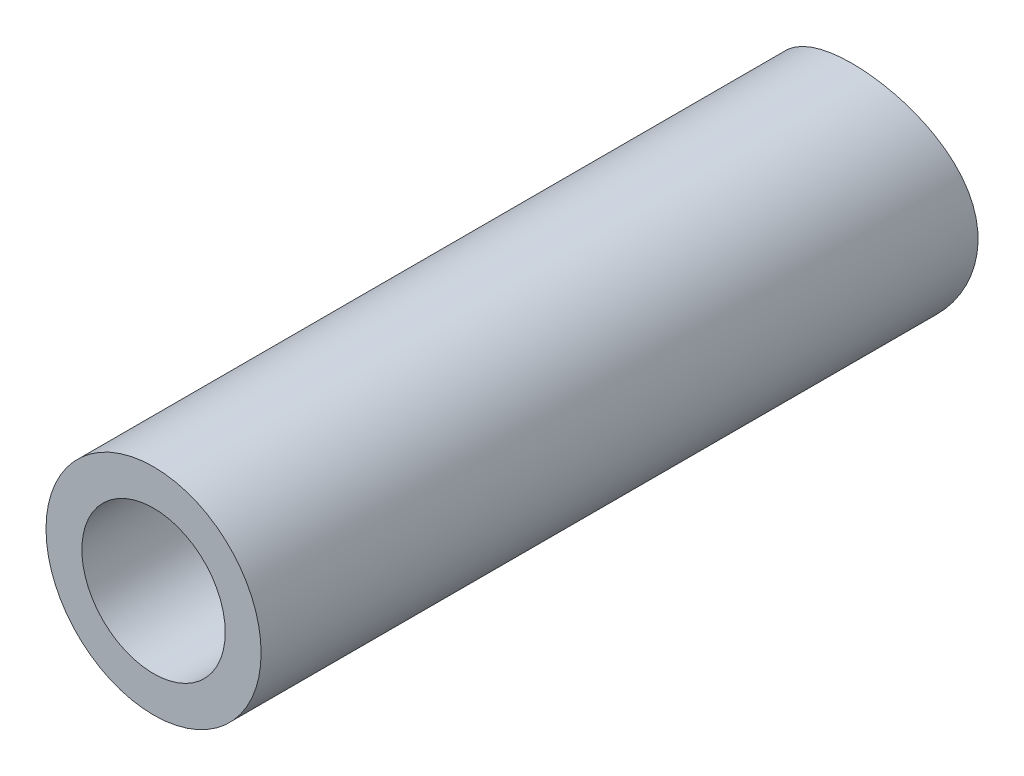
from build123d import *

# Parameters (mm, degrees)
SKETCH1_R          = 7.5
EXTRUDE1_DEPTH     = 50
SKETCH2_R          = 22.5
CUT_EXTRUDE1_DEPTH = 25
SKETCH3_R          = 5
CUT_EXTRUDE2_DEPTH = 30
SKETCH4_R          = 2
CUT_EXTRUDE3_DEPTH = 10


with BuildPart() as part:
    # Sketch1 → Extrude1 (new body)
    with BuildSketch(Plane.XY):
        Circle(SKETCH1_R)
    extrude(amount=EXTRUDE1_DEPTH)

    # Sketch2 → Cut-Extrude1 (cut, symmetric)
    with BuildSketch(Plane(origin=(0, 0, 0), x_dir=(1, 0, 0), z_dir=(0, 1, 0))):
        with Locations((0, 21.213203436)):
            Circle(SKETCH2_R)
    extrude(amount=CUT_EXTRUDE1_DEPTH, both=True, mode=Mode.SUBTRACT)

    # Sketch3 → Cut-Extrude2 (cut)
    with BuildSketch(Plane.XY.offset(50)):
        Circle(SKETCH3_R)
    extrude(amount=-CUT_EXTRUDE2_DEPTH, mode=Mode.SUBTRACT)

    # Sketch4 → Cut-Extrude3 (cut)
    with BuildSketch(Plane.XY):
        with Locations(Location((0, 0, 0), (0, 0, 180))):
            Circle(SKETCH4_R)
    extrude(amount=CUT_EXTRUDE3_DEPTH, mode=Mode.SUBTRACT)


solid = part.part
